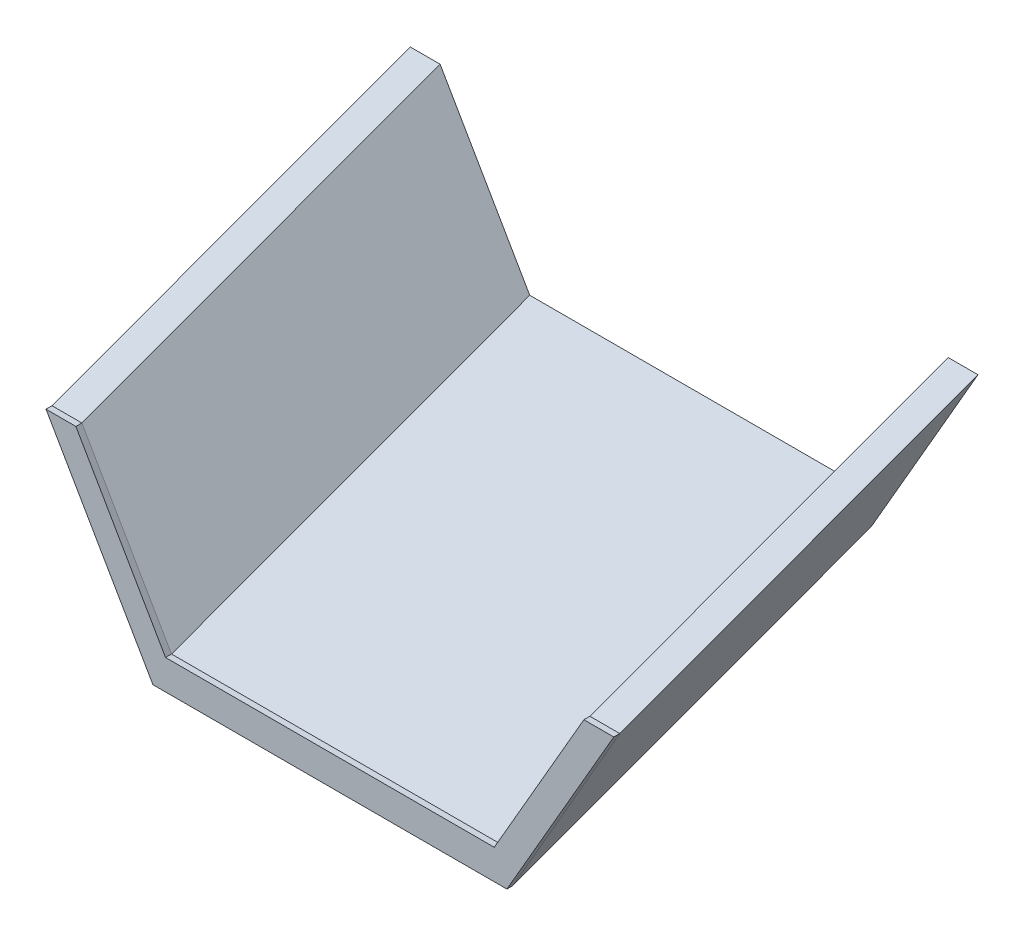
ISO-10303-21;
HEADER;
FILE_DESCRIPTION(('STEP AP214'),'2;1');
FILE_NAME('part.step','',(''),(''),'','','');
FILE_SCHEMA(('AUTOMOTIVE_DESIGN { 1 0 10303 214 1 1 1 1 }'));
ENDSEC;
DATA;
#1=APPLICATION_CONTEXT('core data for automotive mechanical design processes');
#2=APPLICATION_PROTOCOL_DEFINITION('international standard','automotive_design',2000,#1);
#3=PRODUCT_CONTEXT('',#1,'mechanical');
#4=PRODUCT('Part','Part','',(#3));
#5=PRODUCT_RELATED_PRODUCT_CATEGORY('part','',(#4));
#6=PRODUCT_DEFINITION_FORMATION('','',#4);
#7=PRODUCT_DEFINITION_CONTEXT('part definition',#1,'design');
#8=PRODUCT_DEFINITION('design','',#6,#7);
#9=PRODUCT_DEFINITION_SHAPE('','',#8);
#10=(LENGTH_UNIT() NAMED_UNIT(*) SI_UNIT(.MILLI.,.METRE.));
#11=(NAMED_UNIT(*) PLANE_ANGLE_UNIT() SI_UNIT($,.RADIAN.));
#12=(NAMED_UNIT(*) SI_UNIT($,.STERADIAN.) SOLID_ANGLE_UNIT());
#13=UNCERTAINTY_MEASURE_WITH_UNIT(LENGTH_MEASURE(1.E-05),#10,'distance_accuracy_value','');
#14=(GEOMETRIC_REPRESENTATION_CONTEXT(3) GLOBAL_UNCERTAINTY_ASSIGNED_CONTEXT((#13)) GLOBAL_UNIT_ASSIGNED_CONTEXT((#10,
#11,#12)) REPRESENTATION_CONTEXT('',''));
#15=CARTESIAN_POINT('',(0.,0.,0.));
#16=DIRECTION('',(0.,0.,1.));
#17=DIRECTION('',(1.,0.,0.));
#18=AXIS2_PLACEMENT_3D('',#15,#16,#17);
#19=CARTESIAN_POINT('',(38.6541184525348,-10.742280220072,1.));
#20=DIRECTION('',(0.,-1.,0.));
#21=DIRECTION('',(1.,0.,0.));
#22=AXIS2_PLACEMENT_3D('',#19,#20,#21);
#23=PLANE('',#22);
#24=DIRECTION('',(-1.,0.,0.));
#25=VECTOR('',#24,1.);
#26=CARTESIAN_POINT('',(38.6541184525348,-10.742280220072,0.));
#27=LINE('',#26,#25);
#28=CARTESIAN_POINT('',(38.6541184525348,-10.742280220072,0.));
#29=VERTEX_POINT('',#28);
#30=CARTESIAN_POINT('',(-16.3458815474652,-10.742280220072,0.));
#31=VERTEX_POINT('',#30);
#32=EDGE_CURVE('E234',#29,#31,#27,.T.);
#33=ORIENTED_EDGE('',*,*,#32,.T.);
#34=DIRECTION('',(0.,0.,-1.));
#35=VECTOR('',#34,1.);
#36=CARTESIAN_POINT('',(-16.3458815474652,-10.742280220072,1.));
#37=LINE('',#36,#35);
#38=CARTESIAN_POINT('',(-16.3458815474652,-10.742280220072,1.));
#39=VERTEX_POINT('',#38);
#40=EDGE_CURVE('E12',#39,#31,#37,.T.);
#41=ORIENTED_EDGE('',*,*,#40,.F.);
#42=DIRECTION('',(-1.,0.,0.));
#43=VECTOR('',#42,1.);
#44=CARTESIAN_POINT('',(38.6541184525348,-10.742280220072,1.));
#45=LINE('',#44,#43);
#46=CARTESIAN_POINT('',(38.6541184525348,-10.742280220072,1.));
#47=VERTEX_POINT('',#46);
#48=EDGE_CURVE('E190',#47,#39,#45,.T.);
#49=ORIENTED_EDGE('',*,*,#48,.F.);
#50=DIRECTION('',(0.,0.,-1.));
#51=VECTOR('',#50,1.);
#52=CARTESIAN_POINT('',(38.6541184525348,-10.742280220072,1.));
#53=LINE('',#52,#51);
#54=EDGE_CURVE('E155',#47,#29,#53,.T.);
#55=ORIENTED_EDGE('',*,*,#54,.T.);
#56=EDGE_LOOP('',(#33,#41,#49,#55));
#57=FACE_BOUND('',#56,.T.);
#58=ADVANCED_FACE('F137',(#57),#23,.F.);
#59=CARTESIAN_POINT('',(-31.3458815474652,15.2384818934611,1.));
#60=DIRECTION('',(0.866025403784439,0.5,0.));
#61=DIRECTION('',(-0.5,0.866025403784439,0.));
#62=AXIS2_PLACEMENT_3D('',#59,#60,#61);
#63=PLANE('',#62);
#64=DIRECTION('',(0.5,-0.866025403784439,0.));
#65=VECTOR('',#64,1.);
#66=CARTESIAN_POINT('',(-31.3458815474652,15.2384818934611,0.));
#67=LINE('',#66,#65);
#68=CARTESIAN_POINT('',(-31.3458815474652,15.2384818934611,0.));
#69=VERTEX_POINT('',#68);
#70=EDGE_CURVE('E236',#69,#31,#67,.T.);
#71=ORIENTED_EDGE('',*,*,#70,.F.);
#72=DIRECTION('',(0.,0.,-1.));
#73=VECTOR('',#72,1.);
#74=CARTESIAN_POINT('',(-31.3458815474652,15.2384818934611,1.));
#75=LINE('',#74,#73);
#76=CARTESIAN_POINT('',(-31.3458815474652,15.2384818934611,1.));
#77=VERTEX_POINT('',#76);
#78=EDGE_CURVE('E147',#77,#69,#75,.T.);
#79=ORIENTED_EDGE('',*,*,#78,.F.);
#80=DIRECTION('',(0.5,-0.866025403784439,0.));
#81=VECTOR('',#80,1.);
#82=CARTESIAN_POINT('',(-31.3458815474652,15.2384818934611,1.));
#83=LINE('',#82,#81);
#84=EDGE_CURVE('E320',#77,#39,#83,.T.);
#85=ORIENTED_EDGE('',*,*,#84,.T.);
#86=ORIENTED_EDGE('',*,*,#40,.T.);
#87=EDGE_LOOP('',(#71,#79,#85,#86));
#88=FACE_BOUND('',#87,.T.);
#89=ADVANCED_FACE('F270',(#88),#63,.T.);
#90=CARTESIAN_POINT('',(-36.3458815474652,15.2384818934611,1.));
#91=DIRECTION('',(0.,1.,0.));
#92=DIRECTION('',(0.,0.,1.));
#93=AXIS2_PLACEMENT_3D('',#90,#91,#92);
#94=PLANE('',#93);
#95=DIRECTION('',(1.,0.,0.));
#96=VECTOR('',#95,1.);
#97=CARTESIAN_POINT('',(-36.3458815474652,15.2384818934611,0.));
#98=LINE('',#97,#96);
#99=CARTESIAN_POINT('',(-36.3458815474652,15.2384818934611,0.));
#100=VERTEX_POINT('',#99);
#101=EDGE_CURVE('E240',#100,#69,#98,.T.);
#102=ORIENTED_EDGE('',*,*,#101,.F.);
#103=DIRECTION('',(0.,0.,-1.));
#104=VECTOR('',#103,1.);
#105=CARTESIAN_POINT('',(-36.3458815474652,15.2384818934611,1.));
#106=LINE('',#105,#104);
#107=CARTESIAN_POINT('',(-36.3458815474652,15.2384818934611,1.));
#108=VERTEX_POINT('',#107);
#109=EDGE_CURVE('E258',#108,#100,#106,.T.);
#110=ORIENTED_EDGE('',*,*,#109,.F.);
#111=DIRECTION('',(1.,0.,0.));
#112=VECTOR('',#111,1.);
#113=CARTESIAN_POINT('',(-36.3458815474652,15.2384818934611,1.));
#114=LINE('',#113,#112);
#115=EDGE_CURVE('E267',#108,#77,#114,.T.);
#116=ORIENTED_EDGE('',*,*,#115,.T.);
#117=ORIENTED_EDGE('',*,*,#78,.T.);
#118=EDGE_LOOP('',(#102,#110,#116,#117));
#119=FACE_BOUND('',#118,.T.);
#120=ADVANCED_FACE('F264',(#119),#94,.T.);
#121=CARTESIAN_POINT('',(-36.3458815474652,15.2384818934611,1.));
#122=DIRECTION('',(0.86602540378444,0.499999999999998,0.));
#123=DIRECTION('',(-0.499999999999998,0.86602540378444,0.));
#124=AXIS2_PLACEMENT_3D('',#121,#122,#123);
#125=PLANE('',#124);
#126=DIRECTION('',(0.499999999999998,-0.86602540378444,0.));
#127=VECTOR('',#126,1.);
#128=CARTESIAN_POINT('',(-36.3458815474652,15.2384818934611,0.));
#129=LINE('',#128,#127);
#130=CARTESIAN_POINT('',(-18.4591302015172,-15.742280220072,0.));
#131=VERTEX_POINT('',#130);
#132=EDGE_CURVE('E243',#100,#131,#129,.T.);
#133=ORIENTED_EDGE('',*,*,#132,.T.);
#134=DIRECTION('',(0.,0.,-1.));
#135=VECTOR('',#134,1.);
#136=CARTESIAN_POINT('',(-18.4591302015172,-15.742280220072,1.));
#137=LINE('',#136,#135);
#138=CARTESIAN_POINT('',(-18.4591302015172,-15.742280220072,1.));
#139=VERTEX_POINT('',#138);
#140=EDGE_CURVE('E256',#139,#131,#137,.T.);
#141=ORIENTED_EDGE('',*,*,#140,.F.);
#142=DIRECTION('',(0.499999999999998,-0.86602540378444,0.));
#143=VECTOR('',#142,1.);
#144=CARTESIAN_POINT('',(-36.3458815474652,15.2384818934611,1.));
#145=LINE('',#144,#143);
#146=EDGE_CURVE('E323',#108,#139,#145,.T.);
#147=ORIENTED_EDGE('',*,*,#146,.F.);
#148=ORIENTED_EDGE('',*,*,#109,.T.);
#149=EDGE_LOOP('',(#133,#141,#147,#148));
#150=FACE_BOUND('',#149,.T.);
#151=ADVANCED_FACE('F382',(#150),#125,.F.);
#152=CARTESIAN_POINT('',(11.1541184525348,-15.742280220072,1.));
#153=DIRECTION('',(0.,1.,0.));
#154=DIRECTION('',(-1.,0.,0.));
#155=AXIS2_PLACEMENT_3D('',#152,#153,#154);
#156=PLANE('',#155);
#157=DIRECTION('',(1.,0.,0.));
#158=VECTOR('',#157,1.);
#159=CARTESIAN_POINT('',(11.1541184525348,-15.742280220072,0.));
#160=LINE('',#159,#158);
#161=CARTESIAN_POINT('',(40.7673671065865,-15.742280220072,0.));
#162=VERTEX_POINT('',#161);
#163=EDGE_CURVE('E140',#131,#162,#160,.T.);
#164=ORIENTED_EDGE('',*,*,#163,.T.);
#165=DIRECTION('',(0.,0.,-1.));
#166=VECTOR('',#165,1.);
#167=CARTESIAN_POINT('',(40.7673671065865,-15.742280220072,1.));
#168=LINE('',#167,#166);
#169=CARTESIAN_POINT('',(40.7673671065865,-15.742280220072,1.));
#170=VERTEX_POINT('',#169);
#171=EDGE_CURVE('E219',#170,#162,#168,.T.);
#172=ORIENTED_EDGE('',*,*,#171,.F.);
#173=DIRECTION('',(-1.,0.,0.));
#174=VECTOR('',#173,1.);
#175=CARTESIAN_POINT('',(11.1541184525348,-15.742280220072,1.));
#176=LINE('',#175,#174);
#177=EDGE_CURVE('E225',#170,#139,#176,.T.);
#178=ORIENTED_EDGE('',*,*,#177,.T.);
#179=ORIENTED_EDGE('',*,*,#140,.T.);
#180=EDGE_LOOP('',(#164,#172,#178,#179));
#181=FACE_BOUND('',#180,.T.);
#182=ADVANCED_FACE('F325',(#181),#156,.F.);
#183=CARTESIAN_POINT('',(58.6541184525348,15.2384818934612,1.));
#184=DIRECTION('',(0.866025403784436,-0.500000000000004,0.));
#185=DIRECTION('',(0.500000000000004,0.866025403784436,0.));
#186=AXIS2_PLACEMENT_3D('',#183,#184,#185);
#187=PLANE('',#186);
#188=DIRECTION('',(-0.500000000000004,-0.866025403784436,0.));
#189=VECTOR('',#188,1.);
#190=CARTESIAN_POINT('',(58.6541184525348,15.2384818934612,0.));
#191=LINE('',#190,#189);
#192=CARTESIAN_POINT('',(58.6541184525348,15.2384818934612,0.));
#193=VERTEX_POINT('',#192);
#194=EDGE_CURVE('E215',#193,#162,#191,.T.);
#195=ORIENTED_EDGE('',*,*,#194,.F.);
#196=DIRECTION('',(0.,0.,-1.));
#197=VECTOR('',#196,1.);
#198=CARTESIAN_POINT('',(58.6541184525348,15.2384818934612,1.));
#199=LINE('',#198,#197);
#200=CARTESIAN_POINT('',(58.6541184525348,15.2384818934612,1.));
#201=VERTEX_POINT('',#200);
#202=EDGE_CURVE('E209',#201,#193,#199,.T.);
#203=ORIENTED_EDGE('',*,*,#202,.F.);
#204=DIRECTION('',(-0.500000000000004,-0.866025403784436,0.));
#205=VECTOR('',#204,1.);
#206=CARTESIAN_POINT('',(58.6541184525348,15.2384818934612,1.));
#207=LINE('',#206,#205);
#208=EDGE_CURVE('E213',#201,#170,#207,.T.);
#209=ORIENTED_EDGE('',*,*,#208,.T.);
#210=ORIENTED_EDGE('',*,*,#171,.T.);
#211=EDGE_LOOP('',(#195,#203,#209,#210));
#212=FACE_BOUND('',#211,.T.);
#213=ADVANCED_FACE('F211',(#212),#187,.T.);
#214=CARTESIAN_POINT('',(53.6541184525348,15.2384818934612,1.));
#215=DIRECTION('',(0.,1.,0.));
#216=DIRECTION('',(0.,0.,1.));
#217=AXIS2_PLACEMENT_3D('',#214,#215,#216);
#218=PLANE('',#217);
#219=DIRECTION('',(1.,0.,0.));
#220=VECTOR('',#219,1.);
#221=CARTESIAN_POINT('',(53.6541184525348,15.2384818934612,0.));
#222=LINE('',#221,#220);
#223=CARTESIAN_POINT('',(53.6541184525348,15.2384818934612,0.));
#224=VERTEX_POINT('',#223);
#225=EDGE_CURVE('E248',#224,#193,#222,.T.);
#226=ORIENTED_EDGE('',*,*,#225,.F.);
#227=DIRECTION('',(0.,0.,-1.));
#228=VECTOR('',#227,1.);
#229=CARTESIAN_POINT('',(53.6541184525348,15.2384818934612,1.));
#230=LINE('',#229,#228);
#231=CARTESIAN_POINT('',(53.6541184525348,15.2384818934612,1.));
#232=VERTEX_POINT('',#231);
#233=EDGE_CURVE('E179',#232,#224,#230,.T.);
#234=ORIENTED_EDGE('',*,*,#233,.F.);
#235=DIRECTION('',(1.,0.,0.));
#236=VECTOR('',#235,1.);
#237=CARTESIAN_POINT('',(53.6541184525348,15.2384818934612,1.));
#238=LINE('',#237,#236);
#239=EDGE_CURVE('E223',#232,#201,#238,.T.);
#240=ORIENTED_EDGE('',*,*,#239,.T.);
#241=ORIENTED_EDGE('',*,*,#202,.T.);
#242=EDGE_LOOP('',(#226,#234,#240,#241));
#243=FACE_BOUND('',#242,.T.);
#244=ADVANCED_FACE('F228',(#243),#218,.T.);
#245=CARTESIAN_POINT('',(38.6541184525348,-10.742280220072,1.));
#246=DIRECTION('',(-0.866025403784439,0.5,0.));
#247=DIRECTION('',(-0.5,-0.866025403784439,0.));
#248=AXIS2_PLACEMENT_3D('',#245,#246,#247);
#249=PLANE('',#248);
#250=DIRECTION('',(0.5,0.866025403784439,0.));
#251=VECTOR('',#250,1.);
#252=CARTESIAN_POINT('',(38.6541184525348,-10.742280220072,0.));
#253=LINE('',#252,#251);
#254=EDGE_CURVE('E250',#29,#224,#253,.T.);
#255=ORIENTED_EDGE('',*,*,#254,.F.);
#256=ORIENTED_EDGE('',*,*,#54,.F.);
#257=DIRECTION('',(0.5,0.866025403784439,0.));
#258=VECTOR('',#257,1.);
#259=CARTESIAN_POINT('',(38.6541184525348,-10.742280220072,1.));
#260=LINE('',#259,#258);
#261=EDGE_CURVE('E229',#47,#232,#260,.T.);
#262=ORIENTED_EDGE('',*,*,#261,.T.);
#263=ORIENTED_EDGE('',*,*,#233,.T.);
#264=EDGE_LOOP('',(#255,#256,#262,#263));
#265=FACE_BOUND('',#264,.T.);
#266=ADVANCED_FACE('F396',(#265),#249,.T.);
#267=CARTESIAN_POINT('',(0.,0.,1.));
#268=DIRECTION('',(0.,0.,1.));
#269=DIRECTION('',(1.,0.,0.));
#270=AXIS2_PLACEMENT_3D('',#267,#268,#269);
#271=PLANE('',#270);
#272=ORIENTED_EDGE('',*,*,#48,.T.);
#273=ORIENTED_EDGE('',*,*,#84,.F.);
#274=ORIENTED_EDGE('',*,*,#115,.F.);
#275=ORIENTED_EDGE('',*,*,#146,.T.);
#276=ORIENTED_EDGE('',*,*,#177,.F.);
#277=ORIENTED_EDGE('',*,*,#208,.F.);
#278=ORIENTED_EDGE('',*,*,#239,.F.);
#279=ORIENTED_EDGE('',*,*,#261,.F.);
#280=EDGE_LOOP('',(#272,#273,#274,#275,#276,#277,#278,#279));
#281=FACE_BOUND('',#280,.T.);
#282=ADVANCED_FACE('F222',(#281),#271,.T.);
#283=CARTESIAN_POINT('',(-16.3458815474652,-10.742280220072,0.));
#284=DIRECTION('',(0.,0.939089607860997,0.343672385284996));
#285=DIRECTION('',(1.,0.,0.));
#286=AXIS2_PLACEMENT_3D('',#283,#284,#285);
#287=PLANE('',#286);
#288=ORIENTED_EDGE('',*,*,#32,.F.);
#289=DIRECTION('',(-0.000972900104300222,0.343672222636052,-0.939089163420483));
#290=VECTOR('',#289,1.);
#291=CARTESIAN_POINT('',(38.623038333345,0.236620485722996,-30.0000000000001));
#292=LINE('',#291,#290);
#293=CARTESIAN_POINT('',(38.5919582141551,11.215521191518,-60.0000000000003));
#294=VERTEX_POINT('',#293);
#295=EDGE_CURVE('E237',#29,#294,#292,.T.);
#296=ORIENTED_EDGE('',*,*,#295,.T.);
#297=DIRECTION('',(1.,0.,0.));
#298=VECTOR('',#297,1.);
#299=CARTESIAN_POINT('',(11.0919582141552,11.215521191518,-60.0000000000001));
#300=LINE('',#299,#298);
#301=CARTESIAN_POINT('',(-16.4080417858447,11.215521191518,-59.9999999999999));
#302=VERTEX_POINT('',#301);
#303=EDGE_CURVE('E294',#302,#294,#300,.T.);
#304=ORIENTED_EDGE('',*,*,#303,.F.);
#305=DIRECTION('',(-0.000972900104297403,0.343672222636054,-0.939089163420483));
#306=VECTOR('',#305,1.);
#307=CARTESIAN_POINT('',(-16.376961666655,0.236620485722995,-29.9999999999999));
#308=LINE('',#307,#306);
#309=EDGE_CURVE('E290',#31,#302,#308,.T.);
#310=ORIENTED_EDGE('',*,*,#309,.F.);
#311=EDGE_LOOP('',(#288,#296,#304,#310));
#312=FACE_BOUND('',#311,.T.);
#313=ADVANCED_FACE('F356',(#312),#287,.T.);
#314=CARTESIAN_POINT('',(38.6541184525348,-10.742280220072,0.));
#315=DIRECTION('',(-0.851745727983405,0.491755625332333,0.180846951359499));
#316=DIRECTION('',(0.5,0.866025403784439,0.));
#317=AXIS2_PLACEMENT_3D('',#314,#315,#316);
#318=PLANE('',#317);
#319=ORIENTED_EDGE('',*,*,#254,.T.);
#320=DIRECTION('',(-0.00097290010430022,0.343672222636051,-0.939089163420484));
#321=VECTOR('',#320,1.);
#322=CARTESIAN_POINT('',(53.623038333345,26.2173825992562,-30.0000000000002));
#323=LINE('',#322,#321);
#324=CARTESIAN_POINT('',(53.5919582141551,37.1962833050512,-60.0000000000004));
#325=VERTEX_POINT('',#324);
#326=EDGE_CURVE('E345',#224,#325,#323,.T.);
#327=ORIENTED_EDGE('',*,*,#326,.T.);
#328=DIRECTION('',(0.5,0.866025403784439,0.));
#329=VECTOR('',#328,1.);
#330=CARTESIAN_POINT('',(46.0919582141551,24.2059022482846,-60.0000000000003));
#331=LINE('',#330,#329);
#332=EDGE_CURVE('E300',#294,#325,#331,.T.);
#333=ORIENTED_EDGE('',*,*,#332,.F.);
#334=ORIENTED_EDGE('',*,*,#295,.F.);
#335=EDGE_LOOP('',(#319,#327,#333,#334));
#336=FACE_BOUND('',#335,.T.);
#337=ADVANCED_FACE('F361',(#336),#318,.T.);
#338=CARTESIAN_POINT('',(53.6541184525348,15.2384818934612,0.));
#339=DIRECTION('',(0.,0.939089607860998,0.343672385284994));
#340=DIRECTION('',(1.,0.,0.));
#341=AXIS2_PLACEMENT_3D('',#338,#339,#340);
#342=PLANE('',#341);
#343=ORIENTED_EDGE('',*,*,#225,.T.);
#344=DIRECTION('',(-0.000972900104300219,0.343672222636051,-0.939089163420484));
#345=VECTOR('',#344,1.);
#346=CARTESIAN_POINT('',(58.623038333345,26.2173825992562,-30.0000000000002));
#347=LINE('',#346,#345);
#348=CARTESIAN_POINT('',(58.5919582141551,37.1962833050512,-60.0000000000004));
#349=VERTEX_POINT('',#348);
#350=EDGE_CURVE('E337',#193,#349,#347,.T.);
#351=ORIENTED_EDGE('',*,*,#350,.T.);
#352=DIRECTION('',(1.,0.,0.));
#353=VECTOR('',#352,1.);
#354=CARTESIAN_POINT('',(56.0919582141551,37.1962833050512,-60.0000000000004));
#355=LINE('',#354,#353);
#356=EDGE_CURVE('E303',#325,#349,#355,.T.);
#357=ORIENTED_EDGE('',*,*,#356,.F.);
#358=ORIENTED_EDGE('',*,*,#326,.F.);
#359=EDGE_LOOP('',(#343,#351,#357,#358));
#360=FACE_BOUND('',#359,.T.);
#361=ADVANCED_FACE('F438',(#360),#342,.T.);
#362=CARTESIAN_POINT('',(58.6541184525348,15.2384818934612,0.));
#363=DIRECTION('',(0.851745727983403,-0.491755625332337,-0.1808469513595));
#364=DIRECTION('',(-0.500000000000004,-0.866025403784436,0.));
#365=AXIS2_PLACEMENT_3D('',#362,#363,#364);
#366=PLANE('',#365);
#367=ORIENTED_EDGE('',*,*,#194,.T.);
#368=DIRECTION('',(-0.000972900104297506,0.343672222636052,-0.939089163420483));
#369=VECTOR('',#368,1.);
#370=CARTESIAN_POINT('',(40.7362869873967,-4.763379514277,-30.0000000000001));
#371=LINE('',#370,#369);
#372=CARTESIAN_POINT('',(40.705206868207,6.21552119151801,-60.0000000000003));
#373=VERTEX_POINT('',#372);
#374=EDGE_CURVE('E335',#162,#373,#371,.T.);
#375=ORIENTED_EDGE('',*,*,#374,.T.);
#376=DIRECTION('',(-0.5,-0.866025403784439,0.));
#377=VECTOR('',#376,1.);
#378=CARTESIAN_POINT('',(49.6485825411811,21.7059022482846,-60.0000000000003));
#379=LINE('',#378,#377);
#380=EDGE_CURVE('E306',#349,#373,#379,.T.);
#381=ORIENTED_EDGE('',*,*,#380,.F.);
#382=ORIENTED_EDGE('',*,*,#350,.F.);
#383=EDGE_LOOP('',(#367,#375,#381,#382));
#384=FACE_BOUND('',#383,.T.);
#385=ADVANCED_FACE('F332',(#384),#366,.T.);
#386=CARTESIAN_POINT('',(40.7673671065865,-15.742280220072,0.));
#387=DIRECTION('',(0.,-0.939089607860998,-0.343672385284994));
#388=DIRECTION('',(-1.,0.,0.));
#389=AXIS2_PLACEMENT_3D('',#386,#387,#388);
#390=PLANE('',#389);
#391=ORIENTED_EDGE('',*,*,#374,.F.);
#392=ORIENTED_EDGE('',*,*,#163,.F.);
#393=DIRECTION('',(-0.00097290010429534,0.343672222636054,-0.939089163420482));
#394=VECTOR('',#393,1.);
#395=CARTESIAN_POINT('',(-18.4902103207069,-4.763379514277,-29.9999999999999));
#396=LINE('',#395,#394);
#397=CARTESIAN_POINT('',(-18.5212904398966,6.21552119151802,-59.9999999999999));
#398=VERTEX_POINT('',#397);
#399=EDGE_CURVE('E292',#131,#398,#396,.T.);
#400=ORIENTED_EDGE('',*,*,#399,.T.);
#401=DIRECTION('',(-1.,0.,0.));
#402=VECTOR('',#401,1.);
#403=CARTESIAN_POINT('',(11.0919582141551,6.21552119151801,-60.0000000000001));
#404=LINE('',#403,#402);
#405=CARTESIAN_POINT('',(11.0919582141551,6.21552119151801,-60.0000000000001));
#406=VERTEX_POINT('',#405);
#407=EDGE_CURVE('E312',#406,#398,#404,.T.);
#408=ORIENTED_EDGE('',*,*,#407,.F.);
#409=EDGE_CURVE('E309',#373,#406,#404,.T.);
#410=ORIENTED_EDGE('',*,*,#409,.F.);
#411=EDGE_LOOP('',(#391,#392,#400,#408,#410));
#412=FACE_BOUND('',#411,.T.);
#413=ADVANCED_FACE('F340',(#412),#390,.T.);
#414=CARTESIAN_POINT('',(-18.4591302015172,-15.742280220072,0.));
#415=DIRECTION('',(-0.852016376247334,-0.491911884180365,-0.179139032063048));
#416=DIRECTION('',(-0.499999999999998,0.86602540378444,0.));
#417=AXIS2_PLACEMENT_3D('',#414,#415,#416);
#418=PLANE('',#417);
#419=ORIENTED_EDGE('',*,*,#132,.F.);
#420=DIRECTION('',(-0.00097290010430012,0.343672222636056,-0.939089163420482));
#421=VECTOR('',#420,1.);
#422=CARTESIAN_POINT('',(-36.376961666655,26.2173825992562,-29.9999999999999));
#423=LINE('',#422,#421);
#424=CARTESIAN_POINT('',(-36.4080417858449,37.1962833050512,-59.9999999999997));
#425=VERTEX_POINT('',#424);
#426=EDGE_CURVE('E284',#100,#425,#423,.T.);
#427=ORIENTED_EDGE('',*,*,#426,.T.);
#428=DIRECTION('',(-0.500000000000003,0.866025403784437,0.));
#429=VECTOR('',#428,1.);
#430=CARTESIAN_POINT('',(-27.4646661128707,21.7059022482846,-59.9999999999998));
#431=LINE('',#430,#429);
#432=EDGE_CURVE('E313',#398,#425,#431,.T.);
#433=ORIENTED_EDGE('',*,*,#432,.F.);
#434=ORIENTED_EDGE('',*,*,#399,.F.);
#435=EDGE_LOOP('',(#419,#427,#433,#434));
#436=FACE_BOUND('',#435,.T.);
#437=ADVANCED_FACE('F380',(#436),#418,.T.);
#438=CARTESIAN_POINT('',(-36.3458815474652,15.2384818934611,0.));
#439=DIRECTION('',(0.,0.939089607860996,0.343672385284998));
#440=DIRECTION('',(1.,0.,0.));
#441=AXIS2_PLACEMENT_3D('',#438,#439,#440);
#442=PLANE('',#441);
#443=ORIENTED_EDGE('',*,*,#101,.T.);
#444=DIRECTION('',(-0.00097290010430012,0.343672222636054,-0.939089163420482));
#445=VECTOR('',#444,1.);
#446=CARTESIAN_POINT('',(-31.376961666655,26.2173825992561,-29.9999999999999));
#447=LINE('',#446,#445);
#448=CARTESIAN_POINT('',(-31.4080417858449,37.1962833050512,-59.9999999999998));
#449=VERTEX_POINT('',#448);
#450=EDGE_CURVE('E282',#69,#449,#447,.T.);
#451=ORIENTED_EDGE('',*,*,#450,.T.);
#452=DIRECTION('',(1.,0.,0.));
#453=VECTOR('',#452,1.);
#454=CARTESIAN_POINT('',(-33.9080417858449,37.1962833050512,-59.9999999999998));
#455=LINE('',#454,#453);
#456=EDGE_CURVE('E316',#425,#449,#455,.T.);
#457=ORIENTED_EDGE('',*,*,#456,.F.);
#458=ORIENTED_EDGE('',*,*,#426,.F.);
#459=EDGE_LOOP('',(#443,#451,#457,#458));
#460=FACE_BOUND('',#459,.T.);
#461=ADVANCED_FACE('F279',(#460),#442,.T.);
#462=CARTESIAN_POINT('',(-31.3458815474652,15.2384818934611,0.));
#463=DIRECTION('',(0.852016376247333,0.491911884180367,0.179139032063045));
#464=DIRECTION('',(0.5,-0.866025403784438,0.));
#465=AXIS2_PLACEMENT_3D('',#462,#463,#464);
#466=PLANE('',#465);
#467=ORIENTED_EDGE('',*,*,#70,.T.);
#468=ORIENTED_EDGE('',*,*,#309,.T.);
#469=DIRECTION('',(0.500000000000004,-0.866025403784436,0.));
#470=VECTOR('',#469,1.);
#471=CARTESIAN_POINT('',(-23.9080417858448,24.2059022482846,-59.9999999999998));
#472=LINE('',#471,#470);
#473=EDGE_CURVE('E288',#449,#302,#472,.T.);
#474=ORIENTED_EDGE('',*,*,#473,.F.);
#475=ORIENTED_EDGE('',*,*,#450,.F.);
#476=EDGE_LOOP('',(#467,#468,#474,#475));
#477=FACE_BOUND('',#476,.T.);
#478=ADVANCED_FACE('F286',(#477),#466,.T.);
#479=CARTESIAN_POINT('',(-23.9080417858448,24.2059022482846,-59.9999999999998));
#480=DIRECTION('',(0.,0.,-1.));
#481=DIRECTION('',(-1.,0.,0.));
#482=AXIS2_PLACEMENT_3D('',#479,#480,#481);
#483=PLANE('',#482);
#484=ORIENTED_EDGE('',*,*,#303,.T.);
#485=ORIENTED_EDGE('',*,*,#332,.T.);
#486=ORIENTED_EDGE('',*,*,#356,.T.);
#487=ORIENTED_EDGE('',*,*,#380,.T.);
#488=ORIENTED_EDGE('',*,*,#409,.T.);
#489=ORIENTED_EDGE('',*,*,#407,.T.);
#490=ORIENTED_EDGE('',*,*,#432,.T.);
#491=ORIENTED_EDGE('',*,*,#456,.T.);
#492=ORIENTED_EDGE('',*,*,#473,.T.);
#493=EDGE_LOOP('',(#484,#485,#486,#487,#488,#489,#490,#491,#492));
#494=FACE_BOUND('',#493,.T.);
#495=ADVANCED_FACE('F365',(#494),#483,.T.);
#496=CLOSED_SHELL('',(#58,#89,#120,#151,#182,#213,#244,#266,#282,#313,#337,#361,#385,#413,#437,
#461,#478,#495));
#497=MANIFOLD_SOLID_BREP('B2',#496);
#498=ADVANCED_BREP_SHAPE_REPRESENTATION('',(#18,#497),#14);
#499=SHAPE_DEFINITION_REPRESENTATION(#9,#498);
ENDSEC;
END-ISO-10303-21;
